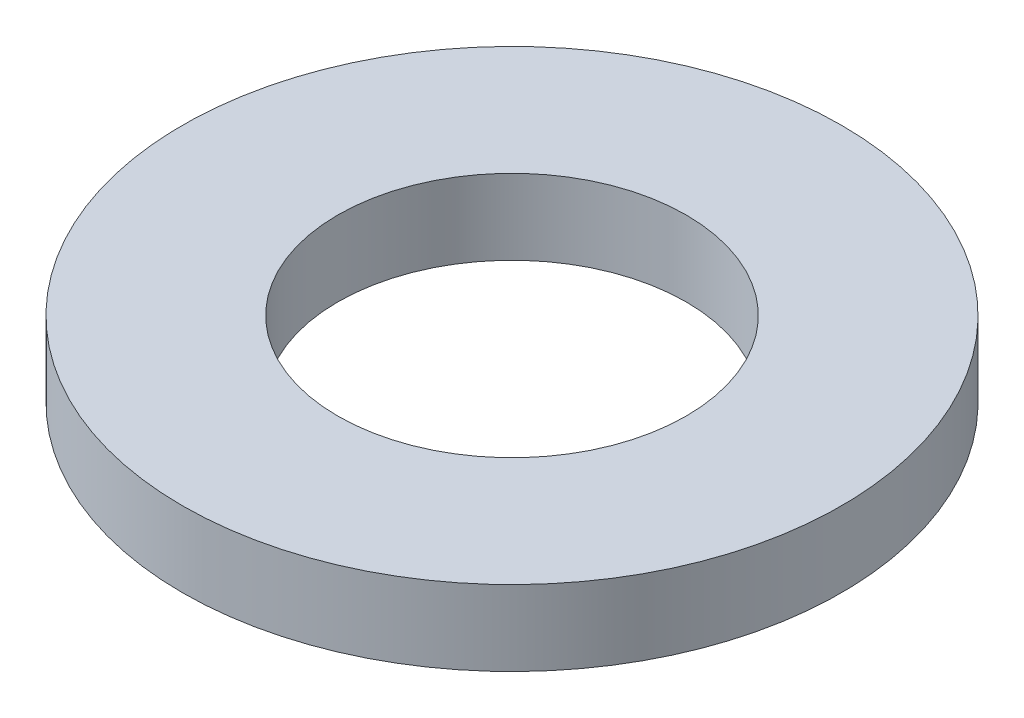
from build123d import *

# Parameters (mm, degrees)
SKETCH1_R      = 7
SKETCH1_R_2    = 3.7
EXTRUDE1_DEPTH = 1.6


with BuildPart() as part:
    # Sketch1 → Extrude1 (new body)
    with BuildSketch(Plane(origin=(0, 0, 0), x_dir=(1, 0, 0), z_dir=(0, 1, 0))):
        with Locations(Location((0, 0, 0), (0, 0, 270))):
            Circle(SKETCH1_R)
        with Locations(Location((0, 0, 0), (0, 0, 270))):
            Circle(SKETCH1_R_2, mode=Mode.SUBTRACT)
    extrude(amount=EXTRUDE1_DEPTH)


solid = part.part
